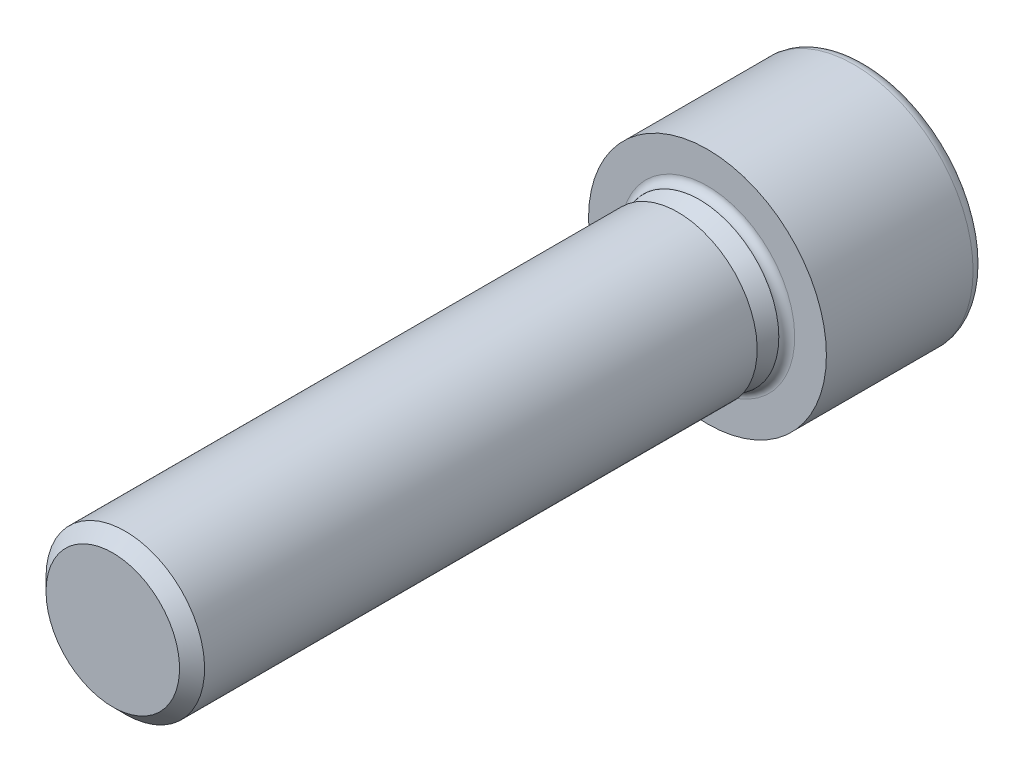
ISO-10303-21;
HEADER;
FILE_DESCRIPTION(('STEP AP214'),'2;1');
FILE_NAME('part.step','',(''),(''),'','','');
FILE_SCHEMA(('AUTOMOTIVE_DESIGN { 1 0 10303 214 1 1 1 1 }'));
ENDSEC;
DATA;
#1=APPLICATION_CONTEXT('core data for automotive mechanical design processes');
#2=APPLICATION_PROTOCOL_DEFINITION('international standard','automotive_design',2000,#1);
#3=PRODUCT_CONTEXT('',#1,'mechanical');
#4=PRODUCT('Part','Part','',(#3));
#5=PRODUCT_RELATED_PRODUCT_CATEGORY('part','',(#4));
#6=PRODUCT_DEFINITION_FORMATION('','',#4);
#7=PRODUCT_DEFINITION_CONTEXT('part definition',#1,'design');
#8=PRODUCT_DEFINITION('design','',#6,#7);
#9=PRODUCT_DEFINITION_SHAPE('','',#8);
#10=(LENGTH_UNIT() NAMED_UNIT(*) SI_UNIT(.MILLI.,.METRE.));
#11=(NAMED_UNIT(*) PLANE_ANGLE_UNIT() SI_UNIT($,.RADIAN.));
#12=(NAMED_UNIT(*) SI_UNIT($,.STERADIAN.) SOLID_ANGLE_UNIT());
#13=UNCERTAINTY_MEASURE_WITH_UNIT(LENGTH_MEASURE(1.E-05),#10,'distance_accuracy_value','');
#14=(GEOMETRIC_REPRESENTATION_CONTEXT(3) GLOBAL_UNCERTAINTY_ASSIGNED_CONTEXT((#13)) GLOBAL_UNIT_ASSIGNED_CONTEXT((#10,
#11,#12)) REPRESENTATION_CONTEXT('',''));
#15=CARTESIAN_POINT('',(0.,0.,0.));
#16=DIRECTION('',(0.,0.,1.));
#17=DIRECTION('',(1.,0.,0.));
#18=AXIS2_PLACEMENT_3D('',#15,#16,#17);
#19=CARTESIAN_POINT('',(0.,0.,-6.02000519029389));
#20=DIRECTION('',(0.,0.,-1.));
#21=DIRECTION('',(-1.,0.,0.));
#22=AXIS2_PLACEMENT_3D('',#19,#20,#21);
#23=CONICAL_SURFACE('',#22,5.80964999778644,1.04719754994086);
#24=CARTESIAN_POINT('',(5.77500000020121,-1.38368243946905E-09,-6.00000000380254));
#25=CARTESIAN_POINT('',(5.64810522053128,-0.219788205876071,-5.92672439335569));
#26=CARTESIAN_POINT('',(5.52012510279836,-0.441456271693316,-5.86007768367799));
#27=CARTESIAN_POINT('',(5.26194894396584,-0.888630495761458,-5.74374726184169));
#28=CARTESIAN_POINT('',(5.13174831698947,-1.11414459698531,-5.69410469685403));
#29=CARTESIAN_POINT('',(4.87294075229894,-1.56241244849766,-5.61684499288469));
#30=CARTESIAN_POINT('',(4.74437411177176,-1.78509640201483,-5.58871319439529));
#31=CARTESIAN_POINT('',(4.55107208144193,-2.11990533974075,-5.56349010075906));
#32=CARTESIAN_POINT('',(4.48659399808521,-2.23158465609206,-5.55791010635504));
#33=CARTESIAN_POINT('',(4.35757830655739,-2.45504638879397,-5.55250311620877));
#34=CARTESIAN_POINT('',(4.29304070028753,-2.56682880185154,-5.55267594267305));
#35=CARTESIAN_POINT('',(4.11624075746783,-2.87305528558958,-5.56106593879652));
#36=CARTESIAN_POINT('',(4.00403705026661,-3.06739780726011,-5.57514684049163));
#37=CARTESIAN_POINT('',(3.78037429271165,-3.4547930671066,-5.61979089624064));
#38=CARTESIAN_POINT('',(3.66891602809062,-3.64784444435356,-5.65036930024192));
#39=CARTESIAN_POINT('',(3.44480291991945,-4.0360197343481,-5.72680486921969));
#40=CARTESIAN_POINT('',(3.33217635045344,-4.23109467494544,-5.77298580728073));
#41=CARTESIAN_POINT('',(3.10860254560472,-4.61833586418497,-5.87779716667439));
#42=CARTESIAN_POINT('',(2.9976524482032,-4.81050706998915,-5.93640297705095));
#43=CARTESIAN_POINT('',(2.88750000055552,-5.00129670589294,-6.00000000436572));
#44=B_SPLINE_CURVE_WITH_KNOTS('',3,(#24,#25,#26,#27,#28,#29,#30,#31,#32,#33,#34,#35,#36,#37,#38,
#39,#40,#41,#42,#43),.UNSPECIFIED.,.F.,.F.,(4,2,2,2,2,2,2,2,2,4),(0.,0.792745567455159,
1.58739611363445,2.36238152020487,2.74950021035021,3.13660693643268,3.8104488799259,
4.484914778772,5.17433709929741,5.86240637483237),.UNSPECIFIED.);
#45=CARTESIAN_POINT('',(5.7749999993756,0.,-6.00000000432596));
#46=VERTEX_POINT('',#45);
#47=CARTESIAN_POINT('',(2.8874999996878,-5.00129670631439,-6.00000000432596));
#48=VERTEX_POINT('',#47);
#49=EDGE_CURVE('E118',#46,#48,#44,.T.);
#50=ORIENTED_EDGE('',*,*,#49,.T.);
#51=CARTESIAN_POINT('',(2.8874999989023,-5.00129670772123,-6.00000000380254));
#52=CARTESIAN_POINT('',(2.65046488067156,-5.00129670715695,-5.93156669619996));
#53=CARTESIAN_POINT('',(2.41155460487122,-5.00129670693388,-5.86891406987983));
#54=CARTESIAN_POINT('',(1.92985312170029,-5.00129670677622,-5.75818332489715));
#55=CARTESIAN_POINT('',(1.68705448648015,-5.00129670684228,-5.71013781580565));
#56=CARTESIAN_POINT('',(1.20418163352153,-5.00129670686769,-5.63287482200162));
#57=CARTESIAN_POINT('',(0.964175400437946,-5.00129670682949,-5.60324540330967));
#58=CARTESIAN_POINT('',(0.482778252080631,-5.00129670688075,-5.56346966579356));
#59=CARTESIAN_POINT('',(0.241389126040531,-5.00129670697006,-5.55330219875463));
#60=CARTESIAN_POINT('',(-0.241389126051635,-5.00129670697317,-5.55330219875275));
#61=CARTESIAN_POINT('',(-0.482778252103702,-5.00129670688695,-5.56346966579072));
#62=CARTESIAN_POINT('',(-0.96417540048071,-5.00129670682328,-5.60324540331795));
#63=CARTESIAN_POINT('',(-1.20418163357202,-5.00129670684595,-5.63287482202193));
#64=CARTESIAN_POINT('',(-1.68705448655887,-5.00129670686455,-5.71013781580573));
#65=CARTESIAN_POINT('',(-1.92985312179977,-5.00129670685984,-5.75818332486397));
#66=CARTESIAN_POINT('',(-2.4115546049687,-5.00129670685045,-5.86891406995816));
#67=CARTESIAN_POINT('',(-2.65046488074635,-5.00129670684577,-5.93156669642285));
#68=CARTESIAN_POINT('',(-2.8874999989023,-5.00129670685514,-6.00000000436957));
#69=B_SPLINE_CURVE_WITH_KNOTS('',3,(#51,#52,#53,#54,#55,#56,#57,#58,#59,#60,#61,#62,#63,#64,#65,
#66,#67,#68),.UNSPECIFIED.,.F.,.F.,(4,2,2,2,2,2,2,2,4),(0.,0.740375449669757,1.48239181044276,
2.20714940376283,2.9311189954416,3.65508858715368,4.37984618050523,5.12186254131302,
5.86223799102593),.UNSPECIFIED.);
#70=CARTESIAN_POINT('',(-2.8874999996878,-5.00129670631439,-6.00000000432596));
#71=VERTEX_POINT('',#70);
#72=EDGE_CURVE('E139',#48,#71,#69,.T.);
#73=ORIENTED_EDGE('',*,*,#72,.T.);
#74=CARTESIAN_POINT('',(-2.88750000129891,-5.00129670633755,-6.00000000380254));
#75=CARTESIAN_POINT('',(-3.01439478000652,-4.78150850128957,-5.92672439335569));
#76=CARTESIAN_POINT('',(-3.14237489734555,-4.55984043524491,-5.86007768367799));
#77=CARTESIAN_POINT('',(-3.4005510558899,-4.11266621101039,-5.74374726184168));
#78=CARTESIAN_POINT('',(-3.53075168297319,-3.88715210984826,-5.69410469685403));
#79=CARTESIAN_POINT('',(-3.78955924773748,-3.4388842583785,-5.61684499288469));
#80=CARTESIAN_POINT('',(-3.91812588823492,-3.21620030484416,-5.58871319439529));
#81=CARTESIAN_POINT('',(-4.11142791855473,-2.88139136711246,-5.56349010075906));
#82=CARTESIAN_POINT('',(-4.17590600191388,-2.76971205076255,-5.55791010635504));
#83=CARTESIAN_POINT('',(-4.30492169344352,-2.54625031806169,-5.55250311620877));
#84=CARTESIAN_POINT('',(-4.36945929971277,-2.43446790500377,-5.55267594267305));
#85=CARTESIAN_POINT('',(-4.54625924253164,-2.12824142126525,-5.56106593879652));
#86=CARTESIAN_POINT('',(-4.65846294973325,-1.93389889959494,-5.57514684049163));
#87=CARTESIAN_POINT('',(-4.88212570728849,-1.54650363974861,-5.61979089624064));
#88=CARTESIAN_POINT('',(-4.99358397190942,-1.3534522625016,-5.65036930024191));
#89=CARTESIAN_POINT('',(-5.2176970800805,-0.965276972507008,-5.72680486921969));
#90=CARTESIAN_POINT('',(-5.33032364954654,-0.770202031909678,-5.77298580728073));
#91=CARTESIAN_POINT('',(-5.5538974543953,-0.382960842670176,-5.87779716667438));
#92=CARTESIAN_POINT('',(-5.66484755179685,-0.190789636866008,-5.93640297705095));
#93=CARTESIAN_POINT('',(-5.77499999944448,-9.6219386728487E-10,-6.00000000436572));
#94=B_SPLINE_CURVE_WITH_KNOTS('',3,(#74,#75,#76,#77,#78,#79,#80,#81,#82,#83,#84,#85,#86,#87,#88,
#89,#90,#91,#92,#93),.UNSPECIFIED.,.F.,.F.,(4,2,2,2,2,2,2,2,2,4),(0.,0.792745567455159,
1.58739611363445,2.36238152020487,2.74950021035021,3.13660693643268,3.8104488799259,
4.484914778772,5.17433709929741,5.86240637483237),.UNSPECIFIED.);
#95=CARTESIAN_POINT('',(-5.7749999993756,0.,-6.00000000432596));
#96=VERTEX_POINT('',#95);
#97=EDGE_CURVE('E146',#71,#96,#94,.T.);
#98=ORIENTED_EDGE('',*,*,#97,.T.);
#99=CARTESIAN_POINT('',(-5.77500000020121,1.38368108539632E-09,-6.00000000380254));
#100=CARTESIAN_POINT('',(-5.64810522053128,0.219788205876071,-5.92672439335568));
#101=CARTESIAN_POINT('',(-5.52012510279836,0.441456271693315,-5.86007768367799));
#102=CARTESIAN_POINT('',(-5.26194894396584,0.888630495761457,-5.74374726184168));
#103=CARTESIAN_POINT('',(-5.13174831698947,1.11414459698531,-5.69410469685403));
#104=CARTESIAN_POINT('',(-4.87294075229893,1.56241244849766,-5.61684499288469));
#105=CARTESIAN_POINT('',(-4.74437411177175,1.78509640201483,-5.58871319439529));
#106=CARTESIAN_POINT('',(-4.55107208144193,2.11990533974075,-5.56349010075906));
#107=CARTESIAN_POINT('',(-4.4865939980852,2.23158465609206,-5.55791010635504));
#108=CARTESIAN_POINT('',(-4.35757830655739,2.45504638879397,-5.55250311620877));
#109=CARTESIAN_POINT('',(-4.29304070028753,2.56682880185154,-5.55267594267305));
#110=CARTESIAN_POINT('',(-4.11624075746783,2.87305528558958,-5.56106593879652));
#111=CARTESIAN_POINT('',(-4.00403705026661,3.06739780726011,-5.57514684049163));
#112=CARTESIAN_POINT('',(-3.78037429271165,3.4547930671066,-5.61979089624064));
#113=CARTESIAN_POINT('',(-3.66891602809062,3.64784444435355,-5.65036930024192));
#114=CARTESIAN_POINT('',(-3.44480291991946,4.0360197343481,-5.72680486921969));
#115=CARTESIAN_POINT('',(-3.33217635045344,4.23109467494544,-5.77298580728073));
#116=CARTESIAN_POINT('',(-3.10860254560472,4.61833586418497,-5.87779716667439));
#117=CARTESIAN_POINT('',(-2.9976524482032,4.81050706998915,-5.93640297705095));
#118=CARTESIAN_POINT('',(-2.88750000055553,5.00129670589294,-6.00000000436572));
#119=B_SPLINE_CURVE_WITH_KNOTS('',3,(#99,#100,#101,#102,#103,#104,#105,#106,#107,#108,#109,#110,
#111,#112,#113,#114,#115,#116,#117,#118),.UNSPECIFIED.,.F.,.F.,(4,2,2,2,2,2,2,2,2,4),(0.,
0.792745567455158,1.58739611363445,2.36238152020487,2.74950021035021,3.13660693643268,
3.8104488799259,4.48491477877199,5.1743370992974,5.86240637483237),.UNSPECIFIED.);
#120=CARTESIAN_POINT('',(-2.8874999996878,5.00129670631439,-6.00000000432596));
#121=VERTEX_POINT('',#120);
#122=EDGE_CURVE('E90',#96,#121,#119,.T.);
#123=ORIENTED_EDGE('',*,*,#122,.T.);
#124=CARTESIAN_POINT('',(-2.8874999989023,5.00129670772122,-6.00000000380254));
#125=CARTESIAN_POINT('',(-2.65046488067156,5.00129670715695,-5.93156669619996));
#126=CARTESIAN_POINT('',(-2.41155460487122,5.00129670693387,-5.86891406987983));
#127=CARTESIAN_POINT('',(-1.92985312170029,5.00129670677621,-5.75818332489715));
#128=CARTESIAN_POINT('',(-1.68705448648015,5.00129670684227,-5.71013781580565));
#129=CARTESIAN_POINT('',(-1.20418163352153,5.00129670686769,-5.63287482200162));
#130=CARTESIAN_POINT('',(-0.964175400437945,5.00129670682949,-5.60324540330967));
#131=CARTESIAN_POINT('',(-0.48277825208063,5.00129670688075,-5.56346966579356));
#132=CARTESIAN_POINT('',(-0.24138912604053,5.00129670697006,-5.55330219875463));
#133=CARTESIAN_POINT('',(0.241389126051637,5.00129670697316,-5.55330219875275));
#134=CARTESIAN_POINT('',(0.482778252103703,5.00129670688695,-5.56346966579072));
#135=CARTESIAN_POINT('',(0.964175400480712,5.00129670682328,-5.60324540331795));
#136=CARTESIAN_POINT('',(1.20418163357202,5.00129670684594,-5.63287482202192));
#137=CARTESIAN_POINT('',(1.68705448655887,5.00129670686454,-5.71013781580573));
#138=CARTESIAN_POINT('',(1.92985312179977,5.00129670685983,-5.75818332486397));
#139=CARTESIAN_POINT('',(2.4115546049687,5.00129670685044,-5.86891406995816));
#140=CARTESIAN_POINT('',(2.65046488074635,5.00129670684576,-5.93156669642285));
#141=CARTESIAN_POINT('',(2.8874999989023,5.00129670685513,-6.00000000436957));
#142=B_SPLINE_CURVE_WITH_KNOTS('',3,(#124,#125,#126,#127,#128,#129,#130,#131,#132,#133,#134,
#135,#136,#137,#138,#139,#140,#141),.UNSPECIFIED.,.F.,.F.,(4,2,2,2,2,2,2,2,4),(0.,
0.740375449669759,1.48239181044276,2.20714940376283,2.9311189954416,3.65508858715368,
4.37984618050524,5.12186254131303,5.86223799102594),.UNSPECIFIED.);
#143=CARTESIAN_POINT('',(2.8874999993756,5.00129670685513,-6.00000000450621));
#144=VERTEX_POINT('',#143);
#145=EDGE_CURVE('E82',#121,#144,#142,.T.);
#146=ORIENTED_EDGE('',*,*,#145,.T.);
#147=CARTESIAN_POINT('',(2.88750000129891,5.00129670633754,-6.00000000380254));
#148=CARTESIAN_POINT('',(3.01439478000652,4.78150850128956,-5.92672439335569));
#149=CARTESIAN_POINT('',(3.14237489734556,4.55984043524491,-5.86007768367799));
#150=CARTESIAN_POINT('',(3.4005510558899,4.11266621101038,-5.74374726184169));
#151=CARTESIAN_POINT('',(3.53075168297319,3.88715210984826,-5.69410469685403));
#152=CARTESIAN_POINT('',(3.78955924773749,3.4388842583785,-5.61684499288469));
#153=CARTESIAN_POINT('',(3.91812588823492,3.21620030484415,-5.58871319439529));
#154=CARTESIAN_POINT('',(4.11142791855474,2.88139136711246,-5.56349010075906));
#155=CARTESIAN_POINT('',(4.17590600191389,2.76971205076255,-5.55791010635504));
#156=CARTESIAN_POINT('',(4.30492169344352,2.54625031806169,-5.55250311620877));
#157=CARTESIAN_POINT('',(4.36945929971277,2.43446790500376,-5.55267594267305));
#158=CARTESIAN_POINT('',(4.54625924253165,2.12824142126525,-5.56106593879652));
#159=CARTESIAN_POINT('',(4.65846294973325,1.93389889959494,-5.57514684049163));
#160=CARTESIAN_POINT('',(4.8821257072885,1.54650363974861,-5.61979089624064));
#161=CARTESIAN_POINT('',(4.99358397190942,1.3534522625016,-5.65036930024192));
#162=CARTESIAN_POINT('',(5.21769708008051,0.965276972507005,-5.72680486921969));
#163=CARTESIAN_POINT('',(5.33032364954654,0.770202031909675,-5.77298580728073));
#164=CARTESIAN_POINT('',(5.5538974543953,0.382960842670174,-5.87779716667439));
#165=CARTESIAN_POINT('',(5.66484755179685,0.190789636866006,-5.93640297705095));
#166=CARTESIAN_POINT('',(5.77499999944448,9.62193155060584E-10,-6.00000000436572));
#167=B_SPLINE_CURVE_WITH_KNOTS('',3,(#147,#148,#149,#150,#151,#152,#153,#154,#155,#156,#157,
#158,#159,#160,#161,#162,#163,#164,#165,#166),.UNSPECIFIED.,.F.,.F.,(4,2,2,2,2,2,2,2,2,4),(0.,
0.792745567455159,1.58739611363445,2.36238152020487,2.74950021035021,3.13660693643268,
3.8104488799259,4.484914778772,5.17433709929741,5.86240637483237),.UNSPECIFIED.);
#168=EDGE_CURVE('E87',#144,#46,#167,.T.);
#169=ORIENTED_EDGE('',*,*,#168,.T.);
#170=EDGE_LOOP('',(#50,#73,#98,#123,#146,#169));
#171=FACE_BOUND('',#170,.T.);
#172=CARTESIAN_POINT('',(0.,-2.8421709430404E-10,-2.66580219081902));
#173=VERTEX_POINT('',#172);
#174=VERTEX_LOOP('',#173);
#175=FACE_BOUND('',#174,.T.);
#176=ADVANCED_FACE('F16',(#171,#175),#23,.F.);
#177=CARTESIAN_POINT('',(-2.8875,5.00129670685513,-12.));
#178=DIRECTION('',(0.,1.,0.));
#179=DIRECTION('',(0.,0.,1.));
#180=AXIS2_PLACEMENT_3D('',#177,#178,#179);
#181=PLANE('',#180);
#182=ORIENTED_EDGE('',*,*,#145,.F.);
#183=DIRECTION('',(0.,0.,1.));
#184=VECTOR('',#183,1.);
#185=CARTESIAN_POINT('',(-2.8875,5.00129670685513,-12.));
#186=LINE('',#185,#184);
#187=CARTESIAN_POINT('',(-2.8875,5.00129670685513,-12.));
#188=VERTEX_POINT('',#187);
#189=EDGE_CURVE('E93',#121,#188,#186,.F.);
#190=ORIENTED_EDGE('',*,*,#189,.T.);
#191=DIRECTION('',(-1.,0.,0.));
#192=VECTOR('',#191,1.);
#193=CARTESIAN_POINT('',(0.,5.00129670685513,-12.));
#194=LINE('',#193,#192);
#195=CARTESIAN_POINT('',(2.8875,5.00129670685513,-12.));
#196=VERTEX_POINT('',#195);
#197=EDGE_CURVE('E99',#196,#188,#194,.T.);
#198=ORIENTED_EDGE('',*,*,#197,.F.);
#199=DIRECTION('',(0.,0.,1.));
#200=VECTOR('',#199,1.);
#201=CARTESIAN_POINT('',(2.8875,5.00129670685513,-12.));
#202=LINE('',#201,#200);
#203=EDGE_CURVE('E96',#196,#144,#202,.T.);
#204=ORIENTED_EDGE('',*,*,#203,.T.);
#205=EDGE_LOOP('',(#182,#190,#198,#204));
#206=FACE_BOUND('',#205,.T.);
#207=ADVANCED_FACE('F97',(#206),#181,.F.);
#208=CARTESIAN_POINT('',(-5.775,0.,-12.));
#209=DIRECTION('',(-0.866025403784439,0.5,0.));
#210=DIRECTION('',(-0.5,-0.866025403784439,0.));
#211=AXIS2_PLACEMENT_3D('',#208,#209,#210);
#212=PLANE('',#211);
#213=DIRECTION('',(0.,0.,1.));
#214=VECTOR('',#213,1.);
#215=CARTESIAN_POINT('',(-5.775,0.,-12.));
#216=LINE('',#215,#214);
#217=CARTESIAN_POINT('',(-5.775,0.,-12.));
#218=VERTEX_POINT('',#217);
#219=EDGE_CURVE('E154',#96,#218,#216,.F.);
#220=ORIENTED_EDGE('',*,*,#219,.T.);
#221=DIRECTION('',(-0.5,-0.866025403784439,0.));
#222=VECTOR('',#221,1.);
#223=CARTESIAN_POINT('',(-2.8875,5.00129670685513,-12.));
#224=LINE('',#223,#222);
#225=EDGE_CURVE('E107',#188,#218,#224,.T.);
#226=ORIENTED_EDGE('',*,*,#225,.F.);
#227=ORIENTED_EDGE('',*,*,#189,.F.);
#228=ORIENTED_EDGE('',*,*,#122,.F.);
#229=EDGE_LOOP('',(#220,#226,#227,#228));
#230=FACE_BOUND('',#229,.T.);
#231=ADVANCED_FACE('F155',(#230),#212,.F.);
#232=CARTESIAN_POINT('',(-2.8875,-5.00129670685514,-12.));
#233=DIRECTION('',(-0.866025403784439,-0.5,0.));
#234=DIRECTION('',(0.5,-0.866025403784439,0.));
#235=AXIS2_PLACEMENT_3D('',#232,#233,#234);
#236=PLANE('',#235);
#237=DIRECTION('',(0.,0.,-1.));
#238=VECTOR('',#237,1.);
#239=CARTESIAN_POINT('',(-2.8875,-5.00129670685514,-12.));
#240=LINE('',#239,#238);
#241=CARTESIAN_POINT('',(-2.8875,-5.00129670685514,-12.));
#242=VERTEX_POINT('',#241);
#243=EDGE_CURVE('E337',#71,#242,#240,.T.);
#244=ORIENTED_EDGE('',*,*,#243,.T.);
#245=DIRECTION('',(0.5,-0.866025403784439,0.));
#246=VECTOR('',#245,1.);
#247=CARTESIAN_POINT('',(-5.775,0.,-12.));
#248=LINE('',#247,#246);
#249=EDGE_CURVE('E268',#218,#242,#248,.T.);
#250=ORIENTED_EDGE('',*,*,#249,.F.);
#251=ORIENTED_EDGE('',*,*,#219,.F.);
#252=ORIENTED_EDGE('',*,*,#97,.F.);
#253=EDGE_LOOP('',(#244,#250,#251,#252));
#254=FACE_BOUND('',#253,.T.);
#255=ADVANCED_FACE('F158',(#254),#236,.F.);
#256=CARTESIAN_POINT('',(2.8875,-5.00129670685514,-12.));
#257=DIRECTION('',(0.,-1.,0.));
#258=DIRECTION('',(0.,0.,-1.));
#259=AXIS2_PLACEMENT_3D('',#256,#257,#258);
#260=PLANE('',#259);
#261=ORIENTED_EDGE('',*,*,#72,.F.);
#262=DIRECTION('',(0.,0.,1.));
#263=VECTOR('',#262,1.);
#264=CARTESIAN_POINT('',(2.8875,-5.00129670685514,-12.));
#265=LINE('',#264,#263);
#266=CARTESIAN_POINT('',(2.8875,-5.00129670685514,-12.));
#267=VERTEX_POINT('',#266);
#268=EDGE_CURVE('E333',#48,#267,#265,.F.);
#269=ORIENTED_EDGE('',*,*,#268,.T.);
#270=DIRECTION('',(-1.,0.,0.));
#271=VECTOR('',#270,1.);
#272=CARTESIAN_POINT('',(0.,-5.00129670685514,-12.));
#273=LINE('',#272,#271);
#274=EDGE_CURVE('E263',#242,#267,#273,.F.);
#275=ORIENTED_EDGE('',*,*,#274,.F.);
#276=ORIENTED_EDGE('',*,*,#243,.F.);
#277=EDGE_LOOP('',(#261,#269,#275,#276));
#278=FACE_BOUND('',#277,.T.);
#279=ADVANCED_FACE('F162',(#278),#260,.F.);
#280=CARTESIAN_POINT('',(5.775,0.,-12.));
#281=DIRECTION('',(0.866025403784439,-0.5,0.));
#282=DIRECTION('',(0.5,0.866025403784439,0.));
#283=AXIS2_PLACEMENT_3D('',#280,#281,#282);
#284=PLANE('',#283);
#285=DIRECTION('',(0.,0.,1.));
#286=VECTOR('',#285,1.);
#287=CARTESIAN_POINT('',(5.775,0.,-12.));
#288=LINE('',#287,#286);
#289=CARTESIAN_POINT('',(5.775,0.,-12.));
#290=VERTEX_POINT('',#289);
#291=EDGE_CURVE('E103',#46,#290,#288,.F.);
#292=ORIENTED_EDGE('',*,*,#291,.T.);
#293=DIRECTION('',(0.5,0.866025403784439,0.));
#294=VECTOR('',#293,1.);
#295=CARTESIAN_POINT('',(2.8875,-5.00129670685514,-12.));
#296=LINE('',#295,#294);
#297=EDGE_CURVE('E258',#267,#290,#296,.T.);
#298=ORIENTED_EDGE('',*,*,#297,.F.);
#299=ORIENTED_EDGE('',*,*,#268,.F.);
#300=ORIENTED_EDGE('',*,*,#49,.F.);
#301=EDGE_LOOP('',(#292,#298,#299,#300));
#302=FACE_BOUND('',#301,.T.);
#303=ADVANCED_FACE('F166',(#302),#284,.F.);
#304=CARTESIAN_POINT('',(2.8875,5.00129670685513,-12.));
#305=DIRECTION('',(0.866025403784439,0.5,0.));
#306=DIRECTION('',(-0.5,0.866025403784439,0.));
#307=AXIS2_PLACEMENT_3D('',#304,#305,#306);
#308=PLANE('',#307);
#309=ORIENTED_EDGE('',*,*,#203,.F.);
#310=DIRECTION('',(-0.5,0.866025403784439,0.));
#311=VECTOR('',#310,1.);
#312=CARTESIAN_POINT('',(5.775,0.,-12.));
#313=LINE('',#312,#311);
#314=EDGE_CURVE('E256',#290,#196,#313,.T.);
#315=ORIENTED_EDGE('',*,*,#314,.F.);
#316=ORIENTED_EDGE('',*,*,#291,.F.);
#317=ORIENTED_EDGE('',*,*,#168,.F.);
#318=EDGE_LOOP('',(#309,#315,#316,#317));
#319=FACE_BOUND('',#318,.T.);
#320=ADVANCED_FACE('F105',(#319),#308,.F.);
#321=CARTESIAN_POINT('',(0.,-4.05,-12.));
#322=DIRECTION('',(0.,0.,-1.));
#323=DIRECTION('',(-1.,0.,0.));
#324=AXIS2_PLACEMENT_3D('',#321,#322,#323);
#325=PLANE('',#324);
#326=ORIENTED_EDGE('',*,*,#297,.T.);
#327=ORIENTED_EDGE('',*,*,#314,.T.);
#328=ORIENTED_EDGE('',*,*,#197,.T.);
#329=ORIENTED_EDGE('',*,*,#225,.T.);
#330=ORIENTED_EDGE('',*,*,#249,.T.);
#331=ORIENTED_EDGE('',*,*,#274,.T.);
#332=EDGE_LOOP('',(#326,#327,#328,#329,#330,#331));
#333=FACE_BOUND('',#332,.T.);
#334=CARTESIAN_POINT('',(0.,0.,-12.));
#335=DIRECTION('',(0.,0.,1.));
#336=DIRECTION('',(-1.,0.,0.));
#337=AXIS2_PLACEMENT_3D('',#334,#335,#336);
#338=CIRCLE('',#337,8.1);
#339=CARTESIAN_POINT('',(-8.1,0.,-12.));
#340=VERTEX_POINT('',#339);
#341=CARTESIAN_POINT('',(0.,-8.1,-12.));
#342=VERTEX_POINT('',#341);
#343=EDGE_CURVE('E245',#340,#342,#338,.T.);
#344=ORIENTED_EDGE('',*,*,#343,.F.);
#345=CARTESIAN_POINT('',(0.,0.,-12.));
#346=DIRECTION('',(0.,0.,1.));
#347=DIRECTION('',(1.,0.,0.));
#348=AXIS2_PLACEMENT_3D('',#345,#346,#347);
#349=CIRCLE('',#348,8.1);
#350=CARTESIAN_POINT('',(8.1,0.,-12.));
#351=VERTEX_POINT('',#350);
#352=EDGE_CURVE('E37',#351,#340,#349,.T.);
#353=ORIENTED_EDGE('',*,*,#352,.F.);
#354=CARTESIAN_POINT('',(0.,0.,-12.));
#355=DIRECTION('',(0.,0.,1.));
#356=DIRECTION('',(0.,-1.,0.));
#357=AXIS2_PLACEMENT_3D('',#354,#355,#356);
#358=CIRCLE('',#357,8.1);
#359=EDGE_CURVE('E234',#342,#351,#358,.T.);
#360=ORIENTED_EDGE('',*,*,#359,.F.);
#361=EDGE_LOOP('',(#344,#353,#360));
#362=FACE_BOUND('',#361,.T.);
#363=ADVANCED_FACE('F174',(#333,#362),#325,.T.);
#364=CARTESIAN_POINT('',(0.,0.,-11.1));
#365=DIRECTION('',(0.,0.,1.));
#366=DIRECTION('',(-1.,0.,0.));
#367=AXIS2_PLACEMENT_3D('',#364,#365,#366);
#368=TOROIDAL_SURFACE('',#367,8.1,0.9);
#369=ORIENTED_EDGE('',*,*,#352,.T.);
#370=ORIENTED_EDGE('',*,*,#343,.T.);
#371=ORIENTED_EDGE('',*,*,#359,.T.);
#372=EDGE_LOOP('',(#369,#370,#371));
#373=FACE_BOUND('',#372,.T.);
#374=CARTESIAN_POINT('',(0.,0.,-11.1));
#375=DIRECTION('',(0.,0.,1.));
#376=DIRECTION('',(0.,-1.,0.));
#377=AXIS2_PLACEMENT_3D('',#374,#375,#376);
#378=CIRCLE('',#377,9.);
#379=CARTESIAN_POINT('',(0.,-9.,-11.1));
#380=VERTEX_POINT('',#379);
#381=EDGE_CURVE('E231',#380,#380,#378,.T.);
#382=ORIENTED_EDGE('',*,*,#381,.F.);
#383=EDGE_LOOP('',(#382));
#384=FACE_BOUND('',#383,.T.);
#385=ADVANCED_FACE('F208',(#373,#384),#368,.T.);
#386=CARTESIAN_POINT('',(0.,0.,-5.55));
#387=DIRECTION('',(0.,0.,1.));
#388=DIRECTION('',(0.,-1.,0.));
#389=AXIS2_PLACEMENT_3D('',#386,#387,#388);
#390=CYLINDRICAL_SURFACE('',#389,9.);
#391=CARTESIAN_POINT('',(0.,0.,0.));
#392=DIRECTION('',(0.,0.,1.));
#393=DIRECTION('',(0.,-1.,0.));
#394=AXIS2_PLACEMENT_3D('',#391,#392,#393);
#395=CIRCLE('',#394,9.);
#396=CARTESIAN_POINT('',(0.,-9.,0.));
#397=VERTEX_POINT('',#396);
#398=EDGE_CURVE('E116',#397,#397,#395,.T.);
#399=ORIENTED_EDGE('',*,*,#398,.F.);
#400=EDGE_LOOP('',(#399));
#401=FACE_BOUND('',#400,.T.);
#402=ORIENTED_EDGE('',*,*,#381,.T.);
#403=EDGE_LOOP('',(#402));
#404=FACE_BOUND('',#403,.T.);
#405=ADVANCED_FACE('F205',(#401,#404),#390,.T.);
#406=CARTESIAN_POINT('',(0.,-7.8,0.));
#407=DIRECTION('',(0.,0.,1.));
#408=DIRECTION('',(1.,0.,0.));
#409=AXIS2_PLACEMENT_3D('',#406,#407,#408);
#410=PLANE('',#409);
#411=CARTESIAN_POINT('',(0.,0.,0.));
#412=DIRECTION('',(0.,0.,1.));
#413=DIRECTION('',(0.,-1.,0.));
#414=AXIS2_PLACEMENT_3D('',#411,#412,#413);
#415=CIRCLE('',#414,6.6);
#416=CARTESIAN_POINT('',(0.,-6.6,0.));
#417=VERTEX_POINT('',#416);
#418=EDGE_CURVE('E226',#417,#417,#415,.T.);
#419=ORIENTED_EDGE('',*,*,#418,.F.);
#420=EDGE_LOOP('',(#419));
#421=FACE_BOUND('',#420,.T.);
#422=ORIENTED_EDGE('',*,*,#398,.T.);
#423=EDGE_LOOP('',(#422));
#424=FACE_BOUND('',#423,.T.);
#425=ADVANCED_FACE('F202',(#421,#424),#410,.T.);
#426=CARTESIAN_POINT('',(0.,0.,0.6));
#427=DIRECTION('',(0.,0.,1.));
#428=DIRECTION('',(0.,-1.,0.));
#429=AXIS2_PLACEMENT_3D('',#426,#427,#428);
#430=TOROIDAL_SURFACE('',#429,6.6,0.6);
#431=CARTESIAN_POINT('',(0.,0.,0.6));
#432=DIRECTION('',(0.,0.,1.));
#433=DIRECTION('',(0.,-1.,0.));
#434=AXIS2_PLACEMENT_3D('',#431,#432,#433);
#435=CIRCLE('',#434,6.);
#436=CARTESIAN_POINT('',(0.,-6.,0.6));
#437=VERTEX_POINT('',#436);
#438=EDGE_CURVE('E223',#437,#437,#435,.T.);
#439=ORIENTED_EDGE('',*,*,#438,.F.);
#440=EDGE_LOOP('',(#439));
#441=FACE_BOUND('',#440,.T.);
#442=ORIENTED_EDGE('',*,*,#418,.T.);
#443=EDGE_LOOP('',(#442));
#444=FACE_BOUND('',#443,.T.);
#445=ADVANCED_FACE('F18',(#441,#444),#430,.F.);
#446=CARTESIAN_POINT('',(0.,0.,0.6005));
#447=DIRECTION('',(0.,0.,1.));
#448=DIRECTION('',(0.,-1.,0.));
#449=AXIS2_PLACEMENT_3D('',#446,#447,#448);
#450=CYLINDRICAL_SURFACE('',#449,6.);
#451=CARTESIAN_POINT('',(0.,0.,0.60099999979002));
#452=DIRECTION('',(0.,0.,-1.));
#453=DIRECTION('',(0.,-1.,0.));
#454=AXIS2_PLACEMENT_3D('',#451,#452,#453);
#455=CIRCLE('',#454,5.99999999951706);
#456=CARTESIAN_POINT('',(0.,-5.99999999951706,0.60099999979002));
#457=VERTEX_POINT('',#456);
#458=EDGE_CURVE('E225',#457,#457,#455,.F.);
#459=ORIENTED_EDGE('',*,*,#458,.F.);
#460=EDGE_LOOP('',(#459));
#461=FACE_BOUND('',#460,.T.);
#462=ORIENTED_EDGE('',*,*,#438,.T.);
#463=EDGE_LOOP('',(#462));
#464=FACE_BOUND('',#463,.T.);
#465=ADVANCED_FACE('F197',(#461,#464),#450,.T.);
#466=CARTESIAN_POINT('',(0.,0.,0.600999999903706));
#467=DIRECTION('',(0.,0.,-1.));
#468=DIRECTION('',(0.,1.,0.));
#469=AXIS2_PLACEMENT_3D('',#466,#467,#468);
#470=CONICAL_SURFACE('',#469,5.99999999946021,0.524127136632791);
#471=CARTESIAN_POINT('',(0.,0.,2.23957687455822));
#472=DIRECTION('',(0.,0.,-1.));
#473=DIRECTION('',(0.,1.,0.));
#474=AXIS2_PLACEMENT_3D('',#471,#472,#473);
#475=CIRCLE('',#474,5.052812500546);
#476=CARTESIAN_POINT('',(0.,5.052812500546,2.23957687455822));
#477=VERTEX_POINT('',#476);
#478=EDGE_CURVE('E230',#477,#477,#475,.F.);
#479=ORIENTED_EDGE('',*,*,#478,.F.);
#480=EDGE_LOOP('',(#479));
#481=FACE_BOUND('',#480,.T.);
#482=ORIENTED_EDGE('',*,*,#458,.T.);
#483=EDGE_LOOP('',(#482));
#484=FACE_BOUND('',#483,.T.);
#485=ADVANCED_FACE('F193',(#481,#484),#470,.T.);
#486=CARTESIAN_POINT('',(0.,-2.52640625,45.));
#487=DIRECTION('',(0.,0.,1.));
#488=DIRECTION('',(1.,0.,0.));
#489=AXIS2_PLACEMENT_3D('',#486,#487,#488);
#490=PLANE('',#489);
#491=CARTESIAN_POINT('',(0.,0.,45.0000000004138));
#492=DIRECTION('',(0.,0.,-1.));
#493=DIRECTION('',(-1.,0.,0.));
#494=AXIS2_PLACEMENT_3D('',#491,#492,#493);
#495=CIRCLE('',#494,5.05281250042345);
#496=CARTESIAN_POINT('',(-5.05281250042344,0.,45.0000000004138));
#497=VERTEX_POINT('',#496);
#498=EDGE_CURVE('E280',#497,#497,#495,.T.);
#499=ORIENTED_EDGE('',*,*,#498,.F.);
#500=EDGE_LOOP('',(#499));
#501=FACE_BOUND('',#500,.T.);
#502=ADVANCED_FACE('F189',(#501),#490,.T.);
#503=CARTESIAN_POINT('',(0.,-5.52640625,2.23957687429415));
#504=DIRECTION('',(0.,0.,-1.));
#505=DIRECTION('',(-1.,0.,0.));
#506=AXIS2_PLACEMENT_3D('',#503,#504,#505);
#507=PLANE('',#506);
#508=ORIENTED_EDGE('',*,*,#478,.T.);
#509=EDGE_LOOP('',(#508));
#510=FACE_BOUND('',#509,.T.);
#511=CARTESIAN_POINT('',(0.,0.,2.23957687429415));
#512=DIRECTION('',(0.,0.,1.));
#513=DIRECTION('',(0.,-1.,0.));
#514=AXIS2_PLACEMENT_3D('',#511,#512,#513);
#515=CIRCLE('',#514,6.);
#516=CARTESIAN_POINT('',(0.,-6.,2.23957687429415));
#517=VERTEX_POINT('',#516);
#518=EDGE_CURVE('E28',#517,#517,#515,.T.);
#519=ORIENTED_EDGE('',*,*,#518,.F.);
#520=EDGE_LOOP('',(#519));
#521=FACE_BOUND('',#520,.T.);
#522=ADVANCED_FACE('F181',(#510,#521),#507,.T.);
#523=CARTESIAN_POINT('',(0.,0.,44.0528124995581));
#524=DIRECTION('',(0.,0.,-1.));
#525=DIRECTION('',(-1.,0.,0.));
#526=AXIS2_PLACEMENT_3D('',#523,#524,#525);
#527=CONICAL_SURFACE('',#526,5.99999999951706,0.785398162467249);
#528=ORIENTED_EDGE('',*,*,#498,.T.);
#529=EDGE_LOOP('',(#528));
#530=FACE_BOUND('',#529,.T.);
#531=CARTESIAN_POINT('',(0.,0.,44.0528125));
#532=DIRECTION('',(0.,0.,1.));
#533=DIRECTION('',(0.,-1.,0.));
#534=AXIS2_PLACEMENT_3D('',#531,#532,#533);
#535=CIRCLE('',#534,6.);
#536=CARTESIAN_POINT('',(0.,-6.,44.0528125));
#537=VERTEX_POINT('',#536);
#538=EDGE_CURVE('E10',#537,#537,#535,.F.);
#539=ORIENTED_EDGE('',*,*,#538,.F.);
#540=EDGE_LOOP('',(#539));
#541=FACE_BOUND('',#540,.T.);
#542=ADVANCED_FACE('F177',(#530,#541),#527,.T.);
#543=CARTESIAN_POINT('',(0.,0.,23.1461946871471));
#544=DIRECTION('',(0.,0.,1.));
#545=DIRECTION('',(0.,-1.,0.));
#546=AXIS2_PLACEMENT_3D('',#543,#544,#545);
#547=CYLINDRICAL_SURFACE('',#546,6.);
#548=ORIENTED_EDGE('',*,*,#518,.T.);
#549=EDGE_LOOP('',(#548));
#550=FACE_BOUND('',#549,.T.);
#551=ORIENTED_EDGE('',*,*,#538,.T.);
#552=EDGE_LOOP('',(#551));
#553=FACE_BOUND('',#552,.T.);
#554=ADVANCED_FACE('F175',(#550,#553),#547,.T.);
#555=CLOSED_SHELL('',(#176,#207,#231,#255,#279,#303,#320,#363,#385,#405,#425,#445,#465,#485,
#502,#522,#542,#554));
#556=MANIFOLD_SOLID_BREP('B1',#555);
#557=ADVANCED_BREP_SHAPE_REPRESENTATION('',(#18,#556),#14);
#558=SHAPE_DEFINITION_REPRESENTATION(#9,#557);
ENDSEC;
END-ISO-10303-21;
